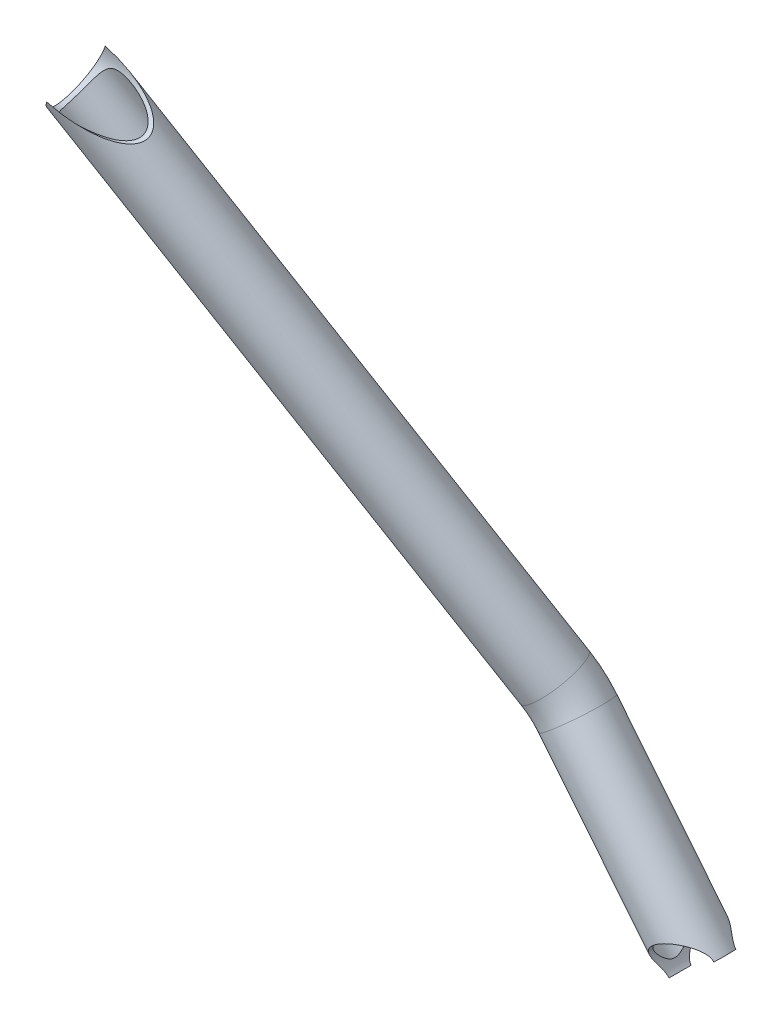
from build123d import *

# Parameters (mm, degrees)
ESQUISSE2_R             = 15
ESQUISSE2_R_2           = 13
ESQUISSE3_R             = 14
ENL_V_MAT_EXTRU_1_DEPTH = 364.938107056
ESQUISSE4_R             = 15
ENL_V_MAT_EXTRU_2_DEPTH = 364.93810706


with BuildPart() as part:
    # Balayage2: sweep along a path in Esquisse1
    with BuildLine(Plane(origin=(-85.140727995, -68.812369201, 0), x_dir=(0, 0, 1), z_dir=(-0.7777408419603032, -0.6285850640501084, 3.747002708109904e-15))) as balayage2_path:
        Line((-164.226280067, -94.507521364), (-164.226280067, 2.097400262))
        ThreePointArc((-164.226280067, 2.097400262), (-163.758785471, 9.57274643), (-162.363586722, 16.931603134))
        Line((-162.363586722, 16.931603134), (-95, 280.938879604))
    # Esquisse2 → Balayage2 (sweep)
    with BuildSketch(Plane(origin=(59.40601637, -73.502359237, 0), x_dir=(-0.7777408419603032, -0.6285850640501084, 0), z_dir=(-0.6285850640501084, 0.7777408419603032, 0))):
        with Locations((109.471848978, -164.226280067)):
            Circle(ESQUISSE2_R)
        with Locations((109.471848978, -164.226280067)):
            Circle(ESQUISSE2_R_2, mode=Mode.SUBTRACT)
    sweep(path=balayage2_path.line)

    # Esquisse3 → Enl_v. mat.-Extru.1 (cut, through all)
    with BuildSketch(Plane.XY):
        with Locations((-25.734711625, -142.314728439)):
            Circle(ESQUISSE3_R)
    extrude(amount=-ENL_V_MAT_EXTRU_1_DEPTH, mode=Mode.SUBTRACT)

    # Esquisse4 → Enl_v. mat.-Extru.2 (cut, through all)
    with BuildSketch(Plane(origin=(0, 0, 0), x_dir=(0, 0, -1), z_dir=(1, 0, 0))):
        with Locations((95, 149.685271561)):
            Circle(ESQUISSE4_R)
    extrude(amount=-ENL_V_MAT_EXTRU_2_DEPTH, mode=Mode.SUBTRACT)


solid = part.part
